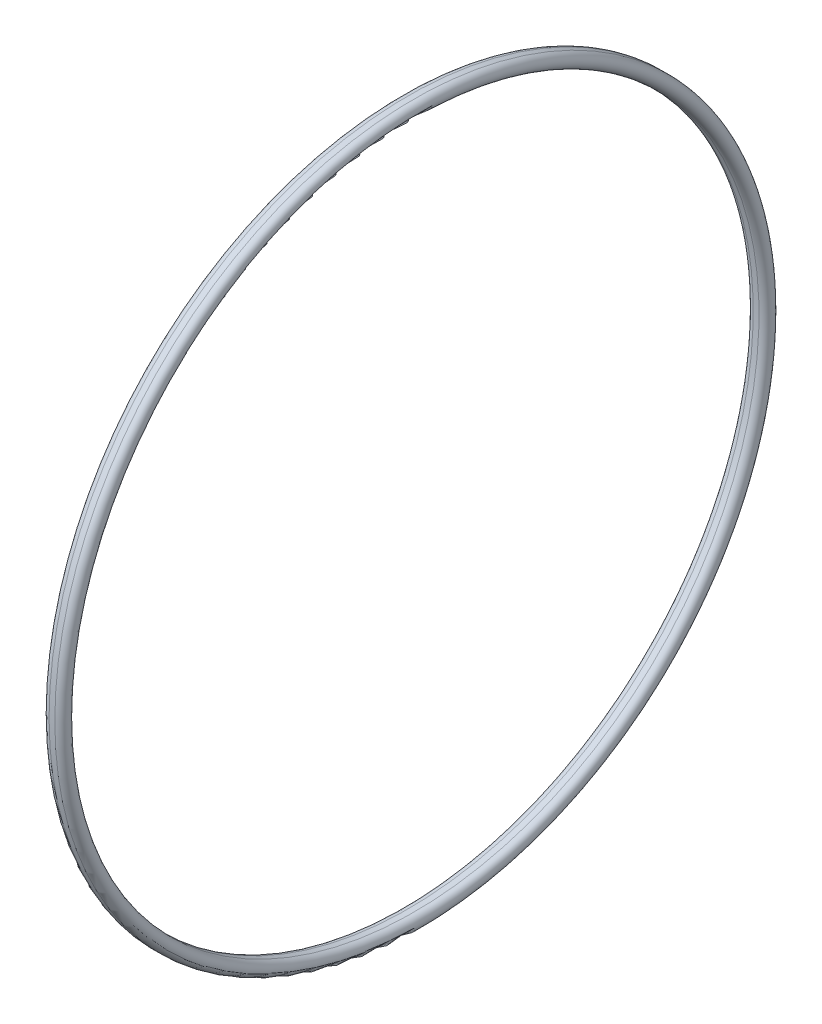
ISO-10303-21;
HEADER;
FILE_DESCRIPTION(('STEP AP214'),'2;1');
FILE_NAME('part.step','',(''),(''),'','','');
FILE_SCHEMA(('AUTOMOTIVE_DESIGN { 1 0 10303 214 1 1 1 1 }'));
ENDSEC;
DATA;
#1=APPLICATION_CONTEXT('core data for automotive mechanical design processes');
#2=APPLICATION_PROTOCOL_DEFINITION('international standard','automotive_design',2000,#1);
#3=PRODUCT_CONTEXT('',#1,'mechanical');
#4=PRODUCT('Part','Part','',(#3));
#5=PRODUCT_RELATED_PRODUCT_CATEGORY('part','',(#4));
#6=PRODUCT_DEFINITION_FORMATION('','',#4);
#7=PRODUCT_DEFINITION_CONTEXT('part definition',#1,'design');
#8=PRODUCT_DEFINITION('design','',#6,#7);
#9=PRODUCT_DEFINITION_SHAPE('','',#8);
#10=(LENGTH_UNIT() NAMED_UNIT(*) SI_UNIT(.MILLI.,.METRE.));
#11=(NAMED_UNIT(*) PLANE_ANGLE_UNIT() SI_UNIT($,.RADIAN.));
#12=(NAMED_UNIT(*) SI_UNIT($,.STERADIAN.) SOLID_ANGLE_UNIT());
#13=UNCERTAINTY_MEASURE_WITH_UNIT(LENGTH_MEASURE(1.E-05),#10,'distance_accuracy_value','');
#14=(GEOMETRIC_REPRESENTATION_CONTEXT(3) GLOBAL_UNCERTAINTY_ASSIGNED_CONTEXT((#13)) GLOBAL_UNIT_ASSIGNED_CONTEXT((#10,
#11,#12)) REPRESENTATION_CONTEXT('',''));
#15=CARTESIAN_POINT('',(0.,0.,0.));
#16=DIRECTION('',(0.,0.,1.));
#17=DIRECTION('',(1.,0.,0.));
#18=AXIS2_PLACEMENT_3D('',#15,#16,#17);
#19=CARTESIAN_POINT('',(-0.254,0.,0.));
#20=DIRECTION('',(-1.,0.,0.));
#21=DIRECTION('',(0.,0.,1.));
#22=AXIS2_PLACEMENT_3D('',#19,#20,#21);
#23=TOROIDAL_SURFACE('',#22,31.12135,0.615950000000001);
#24=CARTESIAN_POINT('',(-0.254,0.,0.));
#25=DIRECTION('',(-1.,0.,0.));
#26=DIRECTION('',(0.,0.,1.));
#27=AXIS2_PLACEMENT_3D('',#24,#25,#26);
#28=CIRCLE('',#27,30.5054);
#29=CARTESIAN_POINT('',(-0.254,0.,30.5054));
#30=VERTEX_POINT('',#29);
#31=EDGE_CURVE('E10',#30,#30,#28,.T.);
#32=ORIENTED_EDGE('',*,*,#31,.F.);
#33=EDGE_LOOP('',(#32));
#34=FACE_BOUND('',#33,.T.);
#35=CARTESIAN_POINT('',(-0.254,0.,0.));
#36=DIRECTION('',(-1.,0.,0.));
#37=DIRECTION('',(0.,0.,1.));
#38=AXIS2_PLACEMENT_3D('',#35,#36,#37);
#39=CIRCLE('',#38,31.7373);
#40=CARTESIAN_POINT('',(-0.254,0.,31.7373));
#41=VERTEX_POINT('',#40);
#42=EDGE_CURVE('E395',#41,#41,#39,.T.);
#43=ORIENTED_EDGE('',*,*,#42,.T.);
#44=EDGE_LOOP('',(#43));
#45=FACE_BOUND('',#44,.T.);
#46=ADVANCED_FACE('F381',(#34,#45),#23,.T.);
#47=CARTESIAN_POINT('',(0.,0.,0.));
#48=DIRECTION('',(-1.,0.,0.));
#49=DIRECTION('',(0.,0.,1.));
#50=AXIS2_PLACEMENT_3D('',#47,#48,#49);
#51=CYLINDRICAL_SURFACE('',#50,30.5054);
#52=CARTESIAN_POINT('',(0.254,0.,0.));
#53=DIRECTION('',(-1.,0.,0.));
#54=DIRECTION('',(0.,0.,1.));
#55=AXIS2_PLACEMENT_3D('',#52,#53,#54);
#56=CIRCLE('',#55,30.5054);
#57=CARTESIAN_POINT('',(0.254,0.,30.5054));
#58=VERTEX_POINT('',#57);
#59=EDGE_CURVE('E387',#58,#58,#56,.T.);
#60=ORIENTED_EDGE('',*,*,#59,.F.);
#61=EDGE_LOOP('',(#60));
#62=FACE_BOUND('',#61,.T.);
#63=ORIENTED_EDGE('',*,*,#31,.T.);
#64=EDGE_LOOP('',(#63));
#65=FACE_BOUND('',#64,.T.);
#66=ADVANCED_FACE('F410',(#62,#65),#51,.F.);
#67=CARTESIAN_POINT('',(0.254,0.,0.));
#68=DIRECTION('',(-1.,0.,0.));
#69=DIRECTION('',(0.,0.,1.));
#70=AXIS2_PLACEMENT_3D('',#67,#68,#69);
#71=TOROIDAL_SURFACE('',#70,31.12135,0.615950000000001);
#72=CARTESIAN_POINT('',(0.254,0.,0.));
#73=DIRECTION('',(-1.,0.,0.));
#74=DIRECTION('',(0.,0.,1.));
#75=AXIS2_PLACEMENT_3D('',#72,#73,#74);
#76=CIRCLE('',#75,31.7373);
#77=CARTESIAN_POINT('',(0.254,0.,31.7373));
#78=VERTEX_POINT('',#77);
#79=EDGE_CURVE('E391',#78,#78,#76,.T.);
#80=ORIENTED_EDGE('',*,*,#79,.F.);
#81=EDGE_LOOP('',(#80));
#82=FACE_BOUND('',#81,.T.);
#83=ORIENTED_EDGE('',*,*,#59,.T.);
#84=EDGE_LOOP('',(#83));
#85=FACE_BOUND('',#84,.T.);
#86=ADVANCED_FACE('F405',(#82,#85),#71,.T.);
#87=CARTESIAN_POINT('',(0.,0.,0.));
#88=DIRECTION('',(-1.,0.,0.));
#89=DIRECTION('',(0.,0.,1.));
#90=AXIS2_PLACEMENT_3D('',#87,#88,#89);
#91=CYLINDRICAL_SURFACE('',#90,31.7373);
#92=ORIENTED_EDGE('',*,*,#42,.F.);
#93=EDGE_LOOP('',(#92));
#94=FACE_BOUND('',#93,.T.);
#95=ORIENTED_EDGE('',*,*,#79,.T.);
#96=EDGE_LOOP('',(#95));
#97=FACE_BOUND('',#96,.T.);
#98=ADVANCED_FACE('F402',(#94,#97),#91,.T.);
#99=CLOSED_SHELL('',(#46,#66,#86,#98));
#100=MANIFOLD_SOLID_BREP('B2',#99);
#101=ADVANCED_BREP_SHAPE_REPRESENTATION('',(#18,#100),#14);
#102=SHAPE_DEFINITION_REPRESENTATION(#9,#101);
ENDSEC;
END-ISO-10303-21;
